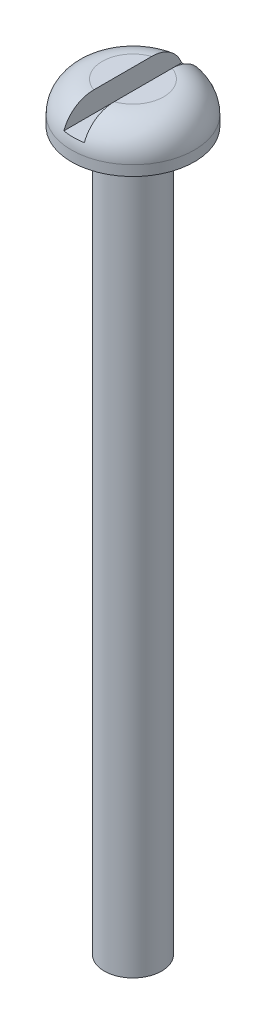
from build123d import *

# Parameters (mm, degrees)
ESQUISSE1_R             = 2.8
EXTRUSION1_DEPTH        = 70
ESQUISSE3_W             = 2
ESQUISSE3_H             = 2.355089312
ENL_V_MAT_EXTRU_1_DEPTH = 6.5


with BuildPart() as part:
    # Esquisse1 → Extrusion1 (new body)
    with BuildSketch(Plane(origin=(0, 6.4, 0), x_dir=(-1, 0, 0), z_dir=(0, 1, 0))):
        with Locations(Location((0, 0, 0), (0, 0, 90))):
            Circle(ESQUISSE1_R)
    extrude(amount=-EXTRUSION1_DEPTH)

    # Esquisse2 → R_volution1 (revolve)
    with BuildSketch(Plane.XY, mode=Mode.PRIVATE) as r_volution1_sk:
        with BuildLine():
            Line((-3, 10.4), (0, 10.4))
            Line((0, 10.4), (0, 6.4))
            Line((0, 6.4), (-6, 6.4))
            Line((-6, 6.4), (-6, 7.4))
            ThreePointArc((-6, 7.4), (-5.121320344, 9.521320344), (-3, 10.4))
        make_face()
    revolve(r_volution1_sk.sketch.rotate(Axis((0, 12, 0), (0, -1, 0)), 270), axis=Axis((0, 12, 0), (0, -1, 0)))

    # Esquisse3 → Enl_v. mat.-Extru.1 (cut, symmetric)
    with BuildSketch(Plane.XY):
        with Locations((0, 9.572737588)):
            Rectangle(ESQUISSE3_W, ESQUISSE3_H)
    extrude(amount=ENL_V_MAT_EXTRU_1_DEPTH, both=True, mode=Mode.SUBTRACT)


solid = part.part
